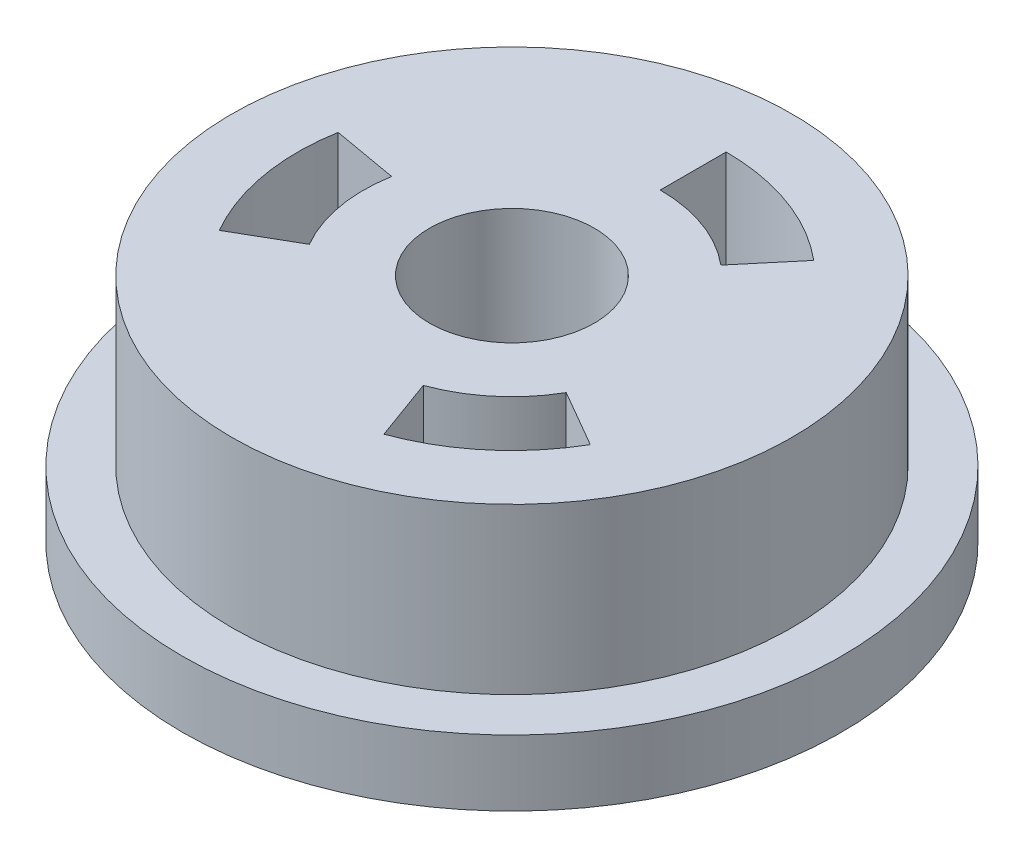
ISO-10303-21;
HEADER;
FILE_DESCRIPTION(('STEP AP214'),'2;1');
FILE_NAME('part.step','',(''),(''),'','','');
FILE_SCHEMA(('AUTOMOTIVE_DESIGN { 1 0 10303 214 1 1 1 1 }'));
ENDSEC;
DATA;
#1=APPLICATION_CONTEXT('core data for automotive mechanical design processes');
#2=APPLICATION_PROTOCOL_DEFINITION('international standard','automotive_design',2000,#1);
#3=PRODUCT_CONTEXT('',#1,'mechanical');
#4=PRODUCT('Part','Part','',(#3));
#5=PRODUCT_RELATED_PRODUCT_CATEGORY('part','',(#4));
#6=PRODUCT_DEFINITION_FORMATION('','',#4);
#7=PRODUCT_DEFINITION_CONTEXT('part definition',#1,'design');
#8=PRODUCT_DEFINITION('design','',#6,#7);
#9=PRODUCT_DEFINITION_SHAPE('','',#8);
#10=(LENGTH_UNIT() NAMED_UNIT(*) SI_UNIT(.MILLI.,.METRE.));
#11=(NAMED_UNIT(*) PLANE_ANGLE_UNIT() SI_UNIT($,.RADIAN.));
#12=(NAMED_UNIT(*) SI_UNIT($,.STERADIAN.) SOLID_ANGLE_UNIT());
#13=UNCERTAINTY_MEASURE_WITH_UNIT(LENGTH_MEASURE(1.E-05),#10,'distance_accuracy_value','');
#14=(GEOMETRIC_REPRESENTATION_CONTEXT(3) GLOBAL_UNCERTAINTY_ASSIGNED_CONTEXT((#13)) GLOBAL_UNIT_ASSIGNED_CONTEXT((#10,
#11,#12)) REPRESENTATION_CONTEXT('',''));
#15=CARTESIAN_POINT('',(0.,0.,0.));
#16=DIRECTION('',(0.,0.,1.));
#17=DIRECTION('',(1.,0.,0.));
#18=AXIS2_PLACEMENT_3D('',#15,#16,#17);
#19=CARTESIAN_POINT('',(0.,0.,0.));
#20=DIRECTION('',(0.,1.,0.));
#21=DIRECTION('',(0.,0.,1.));
#22=AXIS2_PLACEMENT_3D('',#19,#20,#21);
#23=PLANE('',#22);
#24=CARTESIAN_POINT('',(0.,0.,0.));
#25=DIRECTION('',(0.,1.,0.));
#26=DIRECTION('',(0.,0.,1.));
#27=AXIS2_PLACEMENT_3D('',#24,#25,#26);
#28=CIRCLE('',#27,9.99999999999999);
#29=CARTESIAN_POINT('',(0.,0.,9.99999999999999));
#30=VERTEX_POINT('',#29);
#31=EDGE_CURVE('E39',#30,#30,#28,.T.);
#32=ORIENTED_EDGE('',*,*,#31,.T.);
#33=EDGE_LOOP('',(#32));
#34=FACE_BOUND('',#33,.T.);
#35=CARTESIAN_POINT('',(0.,0.,0.));
#36=DIRECTION('',(0.,1.,0.));
#37=DIRECTION('',(0.,0.,1.));
#38=AXIS2_PLACEMENT_3D('',#35,#36,#37);
#39=CIRCLE('',#38,8.5);
#40=CARTESIAN_POINT('',(0.,0.,8.5));
#41=VERTEX_POINT('',#40);
#42=EDGE_CURVE('E217',#41,#41,#39,.T.);
#43=ORIENTED_EDGE('',*,*,#42,.F.);
#44=EDGE_LOOP('',(#43));
#45=FACE_BOUND('',#44,.T.);
#46=ADVANCED_FACE('F35',(#34,#45),#23,.T.);
#47=CARTESIAN_POINT('',(0.,-2.,0.));
#48=DIRECTION('',(0.,1.,0.));
#49=DIRECTION('',(0.,0.,1.));
#50=AXIS2_PLACEMENT_3D('',#47,#48,#49);
#51=CYLINDRICAL_SURFACE('',#50,9.99999999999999);
#52=CARTESIAN_POINT('',(0.,-2.,0.));
#53=DIRECTION('',(0.,1.,0.));
#54=DIRECTION('',(0.,0.,1.));
#55=AXIS2_PLACEMENT_3D('',#52,#53,#54);
#56=CIRCLE('',#55,9.99999999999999);
#57=CARTESIAN_POINT('',(0.,-2.,9.99999999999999));
#58=VERTEX_POINT('',#57);
#59=EDGE_CURVE('E11',#58,#58,#56,.T.);
#60=ORIENTED_EDGE('',*,*,#59,.T.);
#61=EDGE_LOOP('',(#60));
#62=FACE_BOUND('',#61,.T.);
#63=ORIENTED_EDGE('',*,*,#31,.F.);
#64=EDGE_LOOP('',(#63));
#65=FACE_BOUND('',#64,.T.);
#66=ADVANCED_FACE('F37',(#62,#65),#51,.T.);
#67=CARTESIAN_POINT('',(0.,-2.,0.));
#68=DIRECTION('',(0.,1.,0.));
#69=DIRECTION('',(0.,0.,1.));
#70=AXIS2_PLACEMENT_3D('',#67,#68,#69);
#71=PLANE('',#70);
#72=CARTESIAN_POINT('',(0.,-2.,0.));
#73=DIRECTION('',(0.,1.,0.));
#74=DIRECTION('',(0.,0.,1.));
#75=AXIS2_PLACEMENT_3D('',#72,#73,#74);
#76=CIRCLE('',#75,2.5);
#77=CARTESIAN_POINT('',(0.,-2.,2.5));
#78=VERTEX_POINT('',#77);
#79=EDGE_CURVE('E156',#78,#78,#76,.T.);
#80=ORIENTED_EDGE('',*,*,#79,.T.);
#81=EDGE_LOOP('',(#80));
#82=FACE_BOUND('',#81,.T.);
#83=ORIENTED_EDGE('',*,*,#59,.F.);
#84=EDGE_LOOP('',(#83));
#85=FACE_BOUND('',#84,.T.);
#86=ADVANCED_FACE('F237',(#82,#85),#71,.F.);
#87=CARTESIAN_POINT('',(0.,5.,0.));
#88=DIRECTION('',(0.,-1.,0.));
#89=DIRECTION('',(0.,0.,-1.));
#90=AXIS2_PLACEMENT_3D('',#87,#88,#89);
#91=CYLINDRICAL_SURFACE('',#90,8.5);
#92=CARTESIAN_POINT('',(0.,5.,0.));
#93=DIRECTION('',(0.,1.,0.));
#94=DIRECTION('',(0.,0.,1.));
#95=AXIS2_PLACEMENT_3D('',#92,#93,#94);
#96=CIRCLE('',#95,8.5);
#97=CARTESIAN_POINT('',(0.,5.,8.5));
#98=VERTEX_POINT('',#97);
#99=EDGE_CURVE('E224',#98,#98,#96,.T.);
#100=ORIENTED_EDGE('',*,*,#99,.F.);
#101=EDGE_LOOP('',(#100));
#102=FACE_BOUND('',#101,.T.);
#103=ORIENTED_EDGE('',*,*,#42,.T.);
#104=EDGE_LOOP('',(#103));
#105=FACE_BOUND('',#104,.T.);
#106=ADVANCED_FACE('F230',(#102,#105),#91,.T.);
#107=CARTESIAN_POINT('',(0.,5.,0.));
#108=DIRECTION('',(0.,1.,0.));
#109=DIRECTION('',(0.,0.,1.));
#110=AXIS2_PLACEMENT_3D('',#107,#108,#109);
#111=PLANE('',#110);
#112=CARTESIAN_POINT('',(0.,5.,0.));
#113=DIRECTION('',(0.,1.,0.));
#114=DIRECTION('',(0.,0.,1.));
#115=AXIS2_PLACEMENT_3D('',#112,#113,#114);
#116=CIRCLE('',#115,2.5);
#117=CARTESIAN_POINT('',(0.,5.,2.5));
#118=VERTEX_POINT('',#117);
#119=EDGE_CURVE('E149',#118,#118,#116,.T.);
#120=ORIENTED_EDGE('',*,*,#119,.F.);
#121=EDGE_LOOP('',(#120));
#122=FACE_BOUND('',#121,.T.);
#123=DIRECTION('',(0.342020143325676,0.,0.939692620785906));
#124=VECTOR('',#123,1.);
#125=CARTESIAN_POINT('',(0.,5.,0.));
#126=LINE('',#125,#124);
#127=CARTESIAN_POINT('',(1.53909064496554,5.,4.22861679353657));
#128=VERTEX_POINT('',#127);
#129=CARTESIAN_POINT('',(2.22313093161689,5.,6.10800203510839));
#130=VERTEX_POINT('',#129);
#131=EDGE_CURVE('E50',#128,#130,#126,.T.);
#132=ORIENTED_EDGE('',*,*,#131,.F.);
#133=CARTESIAN_POINT('',(0.,5.,0.));
#134=DIRECTION('',(0.,1.,0.));
#135=DIRECTION('',(-0.866025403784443,0.,-0.499999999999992));
#136=AXIS2_PLACEMENT_3D('',#133,#134,#135);
#137=CIRCLE('',#136,4.5);
#138=CARTESIAN_POINT('',(3.89711431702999,5.,2.24999999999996));
#139=VERTEX_POINT('',#138);
#140=EDGE_CURVE('E143',#128,#139,#137,.T.);
#141=ORIENTED_EDGE('',*,*,#140,.T.);
#142=DIRECTION('',(0.866025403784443,0.,0.499999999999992));
#143=VECTOR('',#142,1.);
#144=CARTESIAN_POINT('',(0.,5.,0.));
#145=LINE('',#144,#143);
#146=CARTESIAN_POINT('',(5.62916512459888,5.,3.24999999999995));
#147=VERTEX_POINT('',#146);
#148=EDGE_CURVE('E146',#139,#147,#145,.T.);
#149=ORIENTED_EDGE('',*,*,#148,.T.);
#150=CARTESIAN_POINT('',(0.,5.,0.));
#151=DIRECTION('',(0.,1.,0.));
#152=DIRECTION('',(-0.866025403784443,0.,-0.499999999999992));
#153=AXIS2_PLACEMENT_3D('',#150,#151,#152);
#154=CIRCLE('',#153,6.5);
#155=EDGE_CURVE('E155',#130,#147,#154,.T.);
#156=ORIENTED_EDGE('',*,*,#155,.F.);
#157=EDGE_LOOP('',(#132,#141,#149,#156));
#158=FACE_BOUND('',#157,.T.);
#159=DIRECTION('',(-0.984807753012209,0.,-0.173648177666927));
#160=VECTOR('',#159,1.);
#161=CARTESIAN_POINT('',(0.,5.,0.));
#162=LINE('',#161,#160);
#163=CARTESIAN_POINT('',(-4.43163488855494,5.,-0.781416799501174));
#164=VERTEX_POINT('',#163);
#165=CARTESIAN_POINT('',(-6.40125039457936,5.,-1.12871315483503));
#166=VERTEX_POINT('',#165);
#167=EDGE_CURVE('E58',#164,#166,#162,.T.);
#168=ORIENTED_EDGE('',*,*,#167,.F.);
#169=CARTESIAN_POINT('',(0.,5.,0.));
#170=DIRECTION('',(0.,1.,0.));
#171=DIRECTION('',(0.866025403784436,0.,-0.500000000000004));
#172=AXIS2_PLACEMENT_3D('',#169,#170,#171);
#173=CIRCLE('',#172,4.5);
#174=CARTESIAN_POINT('',(-3.89711431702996,5.,2.25000000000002));
#175=VERTEX_POINT('',#174);
#176=EDGE_CURVE('E169',#164,#175,#173,.T.);
#177=ORIENTED_EDGE('',*,*,#176,.T.);
#178=DIRECTION('',(-0.866025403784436,0.,0.500000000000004));
#179=VECTOR('',#178,1.);
#180=CARTESIAN_POINT('',(0.,5.,0.));
#181=LINE('',#180,#179);
#182=CARTESIAN_POINT('',(-5.62916512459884,5.,3.25000000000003));
#183=VERTEX_POINT('',#182);
#184=EDGE_CURVE('E181',#175,#183,#181,.T.);
#185=ORIENTED_EDGE('',*,*,#184,.T.);
#186=CARTESIAN_POINT('',(0.,5.,0.));
#187=DIRECTION('',(0.,1.,0.));
#188=DIRECTION('',(0.866025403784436,0.,-0.500000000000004));
#189=AXIS2_PLACEMENT_3D('',#186,#187,#188);
#190=CIRCLE('',#189,6.5);
#191=EDGE_CURVE('E178',#166,#183,#190,.T.);
#192=ORIENTED_EDGE('',*,*,#191,.F.);
#193=EDGE_LOOP('',(#168,#177,#185,#192));
#194=FACE_BOUND('',#193,.T.);
#195=DIRECTION('',(0.64278760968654,0.,-0.766044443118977));
#196=VECTOR('',#195,1.);
#197=CARTESIAN_POINT('',(0.,5.,0.));
#198=LINE('',#197,#196);
#199=CARTESIAN_POINT('',(2.89254424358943,5.,-3.4471999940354));
#200=VERTEX_POINT('',#199);
#201=CARTESIAN_POINT('',(4.17811946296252,5.,-4.97928888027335));
#202=VERTEX_POINT('',#201);
#203=EDGE_CURVE('E188',#200,#202,#198,.T.);
#204=ORIENTED_EDGE('',*,*,#203,.F.);
#205=CARTESIAN_POINT('',(0.,5.,0.));
#206=DIRECTION('',(0.,1.,0.));
#207=DIRECTION('',(0.,0.,1.));
#208=AXIS2_PLACEMENT_3D('',#205,#206,#207);
#209=CIRCLE('',#208,4.5);
#210=CARTESIAN_POINT('',(0.,5.,-4.5));
#211=VERTEX_POINT('',#210);
#212=EDGE_CURVE('E198',#200,#211,#209,.T.);
#213=ORIENTED_EDGE('',*,*,#212,.T.);
#214=DIRECTION('',(0.,0.,-1.));
#215=VECTOR('',#214,1.);
#216=CARTESIAN_POINT('',(0.,5.,0.));
#217=LINE('',#216,#215);
#218=CARTESIAN_POINT('',(0.,5.,-6.5));
#219=VERTEX_POINT('',#218);
#220=EDGE_CURVE('E210',#211,#219,#217,.T.);
#221=ORIENTED_EDGE('',*,*,#220,.T.);
#222=CARTESIAN_POINT('',(0.,5.,0.));
#223=DIRECTION('',(0.,1.,0.));
#224=DIRECTION('',(0.,0.,1.));
#225=AXIS2_PLACEMENT_3D('',#222,#223,#224);
#226=CIRCLE('',#225,6.5);
#227=EDGE_CURVE('E207',#202,#219,#226,.T.);
#228=ORIENTED_EDGE('',*,*,#227,.F.);
#229=EDGE_LOOP('',(#204,#213,#221,#228));
#230=FACE_BOUND('',#229,.T.);
#231=ORIENTED_EDGE('',*,*,#99,.T.);
#232=EDGE_LOOP('',(#231));
#233=FACE_BOUND('',#232,.T.);
#234=ADVANCED_FACE('F246',(#122,#158,#194,#230,#233),#111,.T.);
#235=CARTESIAN_POINT('',(0.,2.,0.));
#236=DIRECTION('',(0.766044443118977,0.,0.64278760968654));
#237=DIRECTION('',(0.64278760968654,0.,-0.766044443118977));
#238=AXIS2_PLACEMENT_3D('',#235,#236,#237);
#239=PLANE('',#238);
#240=ORIENTED_EDGE('',*,*,#203,.T.);
#241=DIRECTION('',(0.,1.,0.));
#242=VECTOR('',#241,1.);
#243=CARTESIAN_POINT('',(4.17811946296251,2.,-4.97928888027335));
#244=LINE('',#243,#242);
#245=CARTESIAN_POINT('',(4.17811946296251,2.,-4.97928888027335));
#246=VERTEX_POINT('',#245);
#247=EDGE_CURVE('E205',#246,#202,#244,.T.);
#248=ORIENTED_EDGE('',*,*,#247,.F.);
#249=DIRECTION('',(0.64278760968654,0.,-0.766044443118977));
#250=VECTOR('',#249,1.);
#251=CARTESIAN_POINT('',(0.,2.,0.));
#252=LINE('',#251,#250);
#253=CARTESIAN_POINT('',(2.89254424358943,2.,-3.4471999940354));
#254=VERTEX_POINT('',#253);
#255=EDGE_CURVE('E194',#254,#246,#252,.T.);
#256=ORIENTED_EDGE('',*,*,#255,.F.);
#257=DIRECTION('',(0.,1.,0.));
#258=VECTOR('',#257,1.);
#259=CARTESIAN_POINT('',(2.89254424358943,2.,-3.4471999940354));
#260=LINE('',#259,#258);
#261=EDGE_CURVE('E215',#254,#200,#260,.T.);
#262=ORIENTED_EDGE('',*,*,#261,.T.);
#263=EDGE_LOOP('',(#240,#248,#256,#262));
#264=FACE_BOUND('',#263,.T.);
#265=ADVANCED_FACE('F250',(#264),#239,.F.);
#266=CARTESIAN_POINT('',(0.,2.,0.));
#267=DIRECTION('',(0.,1.,0.));
#268=DIRECTION('',(0.,0.,1.));
#269=AXIS2_PLACEMENT_3D('',#266,#267,#268);
#270=CYLINDRICAL_SURFACE('',#269,4.5);
#271=ORIENTED_EDGE('',*,*,#212,.F.);
#272=ORIENTED_EDGE('',*,*,#261,.F.);
#273=CARTESIAN_POINT('',(0.,2.,0.));
#274=DIRECTION('',(0.,1.,0.));
#275=DIRECTION('',(0.,0.,1.));
#276=AXIS2_PLACEMENT_3D('',#273,#274,#275);
#277=CIRCLE('',#276,4.5);
#278=CARTESIAN_POINT('',(0.,2.,-4.5));
#279=VERTEX_POINT('',#278);
#280=EDGE_CURVE('E203',#254,#279,#277,.T.);
#281=ORIENTED_EDGE('',*,*,#280,.T.);
#282=DIRECTION('',(0.,1.,0.));
#283=VECTOR('',#282,1.);
#284=CARTESIAN_POINT('',(0.,2.,-4.5));
#285=LINE('',#284,#283);
#286=EDGE_CURVE('E218',#279,#211,#285,.T.);
#287=ORIENTED_EDGE('',*,*,#286,.T.);
#288=EDGE_LOOP('',(#271,#272,#281,#287));
#289=FACE_BOUND('',#288,.T.);
#290=ADVANCED_FACE('F254',(#289),#270,.T.);
#291=CARTESIAN_POINT('',(0.,2.,0.));
#292=DIRECTION('',(1.,0.,0.));
#293=DIRECTION('',(0.,0.,-1.));
#294=AXIS2_PLACEMENT_3D('',#291,#292,#293);
#295=PLANE('',#294);
#296=ORIENTED_EDGE('',*,*,#220,.F.);
#297=ORIENTED_EDGE('',*,*,#286,.F.);
#298=DIRECTION('',(0.,0.,-1.));
#299=VECTOR('',#298,1.);
#300=CARTESIAN_POINT('',(0.,2.,0.));
#301=LINE('',#300,#299);
#302=CARTESIAN_POINT('',(0.,2.,-6.5));
#303=VERTEX_POINT('',#302);
#304=EDGE_CURVE('E201',#279,#303,#301,.T.);
#305=ORIENTED_EDGE('',*,*,#304,.T.);
#306=DIRECTION('',(0.,1.,0.));
#307=VECTOR('',#306,1.);
#308=CARTESIAN_POINT('',(0.,2.,-6.5));
#309=LINE('',#308,#307);
#310=EDGE_CURVE('E220',#303,#219,#309,.T.);
#311=ORIENTED_EDGE('',*,*,#310,.T.);
#312=EDGE_LOOP('',(#296,#297,#305,#311));
#313=FACE_BOUND('',#312,.T.);
#314=ADVANCED_FACE('F260',(#313),#295,.T.);
#315=CARTESIAN_POINT('',(0.,2.,0.));
#316=DIRECTION('',(0.,1.,0.));
#317=DIRECTION('',(0.,0.,1.));
#318=AXIS2_PLACEMENT_3D('',#315,#316,#317);
#319=CYLINDRICAL_SURFACE('',#318,6.5);
#320=ORIENTED_EDGE('',*,*,#227,.T.);
#321=ORIENTED_EDGE('',*,*,#310,.F.);
#322=CARTESIAN_POINT('',(0.,2.,0.));
#323=DIRECTION('',(0.,1.,0.));
#324=DIRECTION('',(0.,0.,1.));
#325=AXIS2_PLACEMENT_3D('',#322,#323,#324);
#326=CIRCLE('',#325,6.5);
#327=EDGE_CURVE('E197',#246,#303,#326,.T.);
#328=ORIENTED_EDGE('',*,*,#327,.F.);
#329=ORIENTED_EDGE('',*,*,#247,.T.);
#330=EDGE_LOOP('',(#320,#321,#328,#329));
#331=FACE_BOUND('',#330,.T.);
#332=ADVANCED_FACE('F256',(#331),#319,.F.);
#333=CARTESIAN_POINT('',(0.,2.,0.));
#334=DIRECTION('',(0.,1.,0.));
#335=DIRECTION('',(0.,0.,1.));
#336=AXIS2_PLACEMENT_3D('',#333,#334,#335);
#337=PLANE('',#336);
#338=ORIENTED_EDGE('',*,*,#255,.T.);
#339=ORIENTED_EDGE('',*,*,#327,.T.);
#340=ORIENTED_EDGE('',*,*,#304,.F.);
#341=ORIENTED_EDGE('',*,*,#280,.F.);
#342=EDGE_LOOP('',(#338,#339,#340,#341));
#343=FACE_BOUND('',#342,.T.);
#344=ADVANCED_FACE('F259',(#343),#337,.T.);
#345=CARTESIAN_POINT('',(0.,2.,0.));
#346=DIRECTION('',(0.173648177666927,0.,-0.984807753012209));
#347=DIRECTION('',(-0.984807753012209,0.,-0.173648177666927));
#348=AXIS2_PLACEMENT_3D('',#345,#346,#347);
#349=PLANE('',#348);
#350=ORIENTED_EDGE('',*,*,#167,.T.);
#351=DIRECTION('',(0.,1.,0.));
#352=VECTOR('',#351,1.);
#353=CARTESIAN_POINT('',(-6.40125039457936,2.,-1.12871315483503));
#354=LINE('',#353,#352);
#355=CARTESIAN_POINT('',(-6.40125039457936,2.,-1.12871315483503));
#356=VERTEX_POINT('',#355);
#357=EDGE_CURVE('E176',#356,#166,#354,.T.);
#358=ORIENTED_EDGE('',*,*,#357,.F.);
#359=DIRECTION('',(-0.984807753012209,0.,-0.173648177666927));
#360=VECTOR('',#359,1.);
#361=CARTESIAN_POINT('',(0.,2.,0.));
#362=LINE('',#361,#360);
#363=CARTESIAN_POINT('',(-4.43163488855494,2.,-0.781416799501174));
#364=VERTEX_POINT('',#363);
#365=EDGE_CURVE('E165',#364,#356,#362,.T.);
#366=ORIENTED_EDGE('',*,*,#365,.F.);
#367=DIRECTION('',(0.,1.,0.));
#368=VECTOR('',#367,1.);
#369=CARTESIAN_POINT('',(-4.43163488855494,2.,-0.781416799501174));
#370=LINE('',#369,#368);
#371=EDGE_CURVE('E186',#364,#164,#370,.T.);
#372=ORIENTED_EDGE('',*,*,#371,.T.);
#373=EDGE_LOOP('',(#350,#358,#366,#372));
#374=FACE_BOUND('',#373,.T.);
#375=ADVANCED_FACE('F270',(#374),#349,.F.);
#376=CARTESIAN_POINT('',(0.,2.,0.));
#377=DIRECTION('',(0.,1.,0.));
#378=DIRECTION('',(0.,0.,1.));
#379=AXIS2_PLACEMENT_3D('',#376,#377,#378);
#380=CYLINDRICAL_SURFACE('',#379,4.5);
#381=ORIENTED_EDGE('',*,*,#176,.F.);
#382=ORIENTED_EDGE('',*,*,#371,.F.);
#383=CARTESIAN_POINT('',(0.,2.,0.));
#384=DIRECTION('',(0.,1.,0.));
#385=DIRECTION('',(0.866025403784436,0.,-0.500000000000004));
#386=AXIS2_PLACEMENT_3D('',#383,#384,#385);
#387=CIRCLE('',#386,4.5);
#388=CARTESIAN_POINT('',(-3.89711431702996,2.,2.25000000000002));
#389=VERTEX_POINT('',#388);
#390=EDGE_CURVE('E174',#364,#389,#387,.T.);
#391=ORIENTED_EDGE('',*,*,#390,.T.);
#392=DIRECTION('',(0.,1.,0.));
#393=VECTOR('',#392,1.);
#394=CARTESIAN_POINT('',(-3.89711431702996,2.,2.25000000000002));
#395=LINE('',#394,#393);
#396=EDGE_CURVE('E189',#389,#175,#395,.T.);
#397=ORIENTED_EDGE('',*,*,#396,.T.);
#398=EDGE_LOOP('',(#381,#382,#391,#397));
#399=FACE_BOUND('',#398,.T.);
#400=ADVANCED_FACE('F274',(#399),#380,.T.);
#401=CARTESIAN_POINT('',(0.,2.,0.));
#402=DIRECTION('',(-0.500000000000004,0.,-0.866025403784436));
#403=DIRECTION('',(-0.866025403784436,0.,0.500000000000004));
#404=AXIS2_PLACEMENT_3D('',#401,#402,#403);
#405=PLANE('',#404);
#406=ORIENTED_EDGE('',*,*,#184,.F.);
#407=ORIENTED_EDGE('',*,*,#396,.F.);
#408=DIRECTION('',(-0.866025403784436,0.,0.500000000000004));
#409=VECTOR('',#408,1.);
#410=CARTESIAN_POINT('',(0.,2.,0.));
#411=LINE('',#410,#409);
#412=CARTESIAN_POINT('',(-5.62916512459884,2.,3.25000000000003));
#413=VERTEX_POINT('',#412);
#414=EDGE_CURVE('E172',#389,#413,#411,.T.);
#415=ORIENTED_EDGE('',*,*,#414,.T.);
#416=DIRECTION('',(0.,1.,0.));
#417=VECTOR('',#416,1.);
#418=CARTESIAN_POINT('',(-5.62916512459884,2.,3.25000000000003));
#419=LINE('',#418,#417);
#420=EDGE_CURVE('E191',#413,#183,#419,.T.);
#421=ORIENTED_EDGE('',*,*,#420,.T.);
#422=EDGE_LOOP('',(#406,#407,#415,#421));
#423=FACE_BOUND('',#422,.T.);
#424=ADVANCED_FACE('F279',(#423),#405,.T.);
#425=CARTESIAN_POINT('',(0.,2.,0.));
#426=DIRECTION('',(0.,1.,0.));
#427=DIRECTION('',(0.,0.,1.));
#428=AXIS2_PLACEMENT_3D('',#425,#426,#427);
#429=CYLINDRICAL_SURFACE('',#428,6.5);
#430=ORIENTED_EDGE('',*,*,#191,.T.);
#431=ORIENTED_EDGE('',*,*,#420,.F.);
#432=CARTESIAN_POINT('',(0.,2.,0.));
#433=DIRECTION('',(0.,1.,0.));
#434=DIRECTION('',(0.866025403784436,0.,-0.500000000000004));
#435=AXIS2_PLACEMENT_3D('',#432,#433,#434);
#436=CIRCLE('',#435,6.5);
#437=EDGE_CURVE('E168',#356,#413,#436,.T.);
#438=ORIENTED_EDGE('',*,*,#437,.F.);
#439=ORIENTED_EDGE('',*,*,#357,.T.);
#440=EDGE_LOOP('',(#430,#431,#438,#439));
#441=FACE_BOUND('',#440,.T.);
#442=ADVANCED_FACE('F275',(#441),#429,.F.);
#443=CARTESIAN_POINT('',(0.,2.,0.));
#444=DIRECTION('',(0.,1.,0.));
#445=DIRECTION('',(0.866025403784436,0.,-0.500000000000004));
#446=AXIS2_PLACEMENT_3D('',#443,#444,#445);
#447=PLANE('',#446);
#448=ORIENTED_EDGE('',*,*,#365,.T.);
#449=ORIENTED_EDGE('',*,*,#437,.T.);
#450=ORIENTED_EDGE('',*,*,#414,.F.);
#451=ORIENTED_EDGE('',*,*,#390,.F.);
#452=EDGE_LOOP('',(#448,#449,#450,#451));
#453=FACE_BOUND('',#452,.T.);
#454=ADVANCED_FACE('F278',(#453),#447,.T.);
#455=CARTESIAN_POINT('',(0.,2.,0.));
#456=DIRECTION('',(-0.939692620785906,0.,0.342020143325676));
#457=DIRECTION('',(0.342020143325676,0.,0.939692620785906));
#458=AXIS2_PLACEMENT_3D('',#455,#456,#457);
#459=PLANE('',#458);
#460=ORIENTED_EDGE('',*,*,#131,.T.);
#461=DIRECTION('',(0.,1.,0.));
#462=VECTOR('',#461,1.);
#463=CARTESIAN_POINT('',(2.22313093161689,2.,6.10800203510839));
#464=LINE('',#463,#462);
#465=CARTESIAN_POINT('',(2.22313093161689,2.,6.10800203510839));
#466=VERTEX_POINT('',#465);
#467=EDGE_CURVE('E122',#466,#130,#464,.T.);
#468=ORIENTED_EDGE('',*,*,#467,.F.);
#469=DIRECTION('',(0.342020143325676,0.,0.939692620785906));
#470=VECTOR('',#469,1.);
#471=CARTESIAN_POINT('',(0.,2.,0.));
#472=LINE('',#471,#470);
#473=CARTESIAN_POINT('',(1.53909064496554,2.,4.22861679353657));
#474=VERTEX_POINT('',#473);
#475=EDGE_CURVE('E126',#474,#466,#472,.T.);
#476=ORIENTED_EDGE('',*,*,#475,.F.);
#477=DIRECTION('',(0.,1.,0.));
#478=VECTOR('',#477,1.);
#479=CARTESIAN_POINT('',(1.53909064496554,2.,4.22861679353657));
#480=LINE('',#479,#478);
#481=EDGE_CURVE('E160',#474,#128,#480,.T.);
#482=ORIENTED_EDGE('',*,*,#481,.T.);
#483=EDGE_LOOP('',(#460,#468,#476,#482));
#484=FACE_BOUND('',#483,.T.);
#485=ADVANCED_FACE('F124',(#484),#459,.F.);
#486=CARTESIAN_POINT('',(0.,2.,0.));
#487=DIRECTION('',(0.,1.,0.));
#488=DIRECTION('',(0.,0.,1.));
#489=AXIS2_PLACEMENT_3D('',#486,#487,#488);
#490=CYLINDRICAL_SURFACE('',#489,4.5);
#491=ORIENTED_EDGE('',*,*,#140,.F.);
#492=ORIENTED_EDGE('',*,*,#481,.F.);
#493=CARTESIAN_POINT('',(0.,2.,0.));
#494=DIRECTION('',(0.,1.,0.));
#495=DIRECTION('',(-0.866025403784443,0.,-0.499999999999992));
#496=AXIS2_PLACEMENT_3D('',#493,#494,#495);
#497=CIRCLE('',#496,4.5);
#498=CARTESIAN_POINT('',(3.89711431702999,2.,2.24999999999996));
#499=VERTEX_POINT('',#498);
#500=EDGE_CURVE('E131',#474,#499,#497,.T.);
#501=ORIENTED_EDGE('',*,*,#500,.T.);
#502=DIRECTION('',(0.,1.,0.));
#503=VECTOR('',#502,1.);
#504=CARTESIAN_POINT('',(3.89711431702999,2.,2.24999999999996));
#505=LINE('',#504,#503);
#506=EDGE_CURVE('E162',#499,#139,#505,.T.);
#507=ORIENTED_EDGE('',*,*,#506,.T.);
#508=EDGE_LOOP('',(#491,#492,#501,#507));
#509=FACE_BOUND('',#508,.T.);
#510=ADVANCED_FACE('F292',(#509),#490,.T.);
#511=CARTESIAN_POINT('',(0.,2.,0.));
#512=DIRECTION('',(-0.499999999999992,0.,0.866025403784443));
#513=DIRECTION('',(0.866025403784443,0.,0.499999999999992));
#514=AXIS2_PLACEMENT_3D('',#511,#512,#513);
#515=PLANE('',#514);
#516=ORIENTED_EDGE('',*,*,#148,.F.);
#517=ORIENTED_EDGE('',*,*,#506,.F.);
#518=DIRECTION('',(0.866025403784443,0.,0.499999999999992));
#519=VECTOR('',#518,1.);
#520=CARTESIAN_POINT('',(0.,2.,0.));
#521=LINE('',#520,#519);
#522=CARTESIAN_POINT('',(5.62916512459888,2.,3.24999999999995));
#523=VERTEX_POINT('',#522);
#524=EDGE_CURVE('E139',#499,#523,#521,.T.);
#525=ORIENTED_EDGE('',*,*,#524,.T.);
#526=DIRECTION('',(0.,1.,0.));
#527=VECTOR('',#526,1.);
#528=CARTESIAN_POINT('',(5.62916512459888,2.,3.24999999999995));
#529=LINE('',#528,#527);
#530=EDGE_CURVE('E130',#523,#147,#529,.T.);
#531=ORIENTED_EDGE('',*,*,#530,.T.);
#532=EDGE_LOOP('',(#516,#517,#525,#531));
#533=FACE_BOUND('',#532,.T.);
#534=ADVANCED_FACE('F295',(#533),#515,.T.);
#535=CARTESIAN_POINT('',(0.,2.,0.));
#536=DIRECTION('',(0.,1.,0.));
#537=DIRECTION('',(0.,0.,1.));
#538=AXIS2_PLACEMENT_3D('',#535,#536,#537);
#539=CYLINDRICAL_SURFACE('',#538,6.5);
#540=ORIENTED_EDGE('',*,*,#155,.T.);
#541=ORIENTED_EDGE('',*,*,#530,.F.);
#542=CARTESIAN_POINT('',(0.,2.,0.));
#543=DIRECTION('',(0.,1.,0.));
#544=DIRECTION('',(-0.866025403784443,0.,-0.499999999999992));
#545=AXIS2_PLACEMENT_3D('',#542,#543,#544);
#546=CIRCLE('',#545,6.5);
#547=EDGE_CURVE('E135',#466,#523,#546,.T.);
#548=ORIENTED_EDGE('',*,*,#547,.F.);
#549=ORIENTED_EDGE('',*,*,#467,.T.);
#550=EDGE_LOOP('',(#540,#541,#548,#549));
#551=FACE_BOUND('',#550,.T.);
#552=ADVANCED_FACE('F136',(#551),#539,.F.);
#553=CARTESIAN_POINT('',(0.,2.,0.));
#554=DIRECTION('',(0.,1.,0.));
#555=DIRECTION('',(-0.866025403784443,0.,-0.499999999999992));
#556=AXIS2_PLACEMENT_3D('',#553,#554,#555);
#557=PLANE('',#556);
#558=ORIENTED_EDGE('',*,*,#475,.T.);
#559=ORIENTED_EDGE('',*,*,#547,.T.);
#560=ORIENTED_EDGE('',*,*,#524,.F.);
#561=ORIENTED_EDGE('',*,*,#500,.F.);
#562=EDGE_LOOP('',(#558,#559,#560,#561));
#563=FACE_BOUND('',#562,.T.);
#564=ADVANCED_FACE('F142',(#563),#557,.T.);
#565=CARTESIAN_POINT('',(0.,-2.,0.));
#566=DIRECTION('',(0.,1.,0.));
#567=DIRECTION('',(0.,0.,1.));
#568=AXIS2_PLACEMENT_3D('',#565,#566,#567);
#569=CYLINDRICAL_SURFACE('',#568,2.5);
#570=ORIENTED_EDGE('',*,*,#79,.F.);
#571=EDGE_LOOP('',(#570));
#572=FACE_BOUND('',#571,.T.);
#573=ORIENTED_EDGE('',*,*,#119,.T.);
#574=EDGE_LOOP('',(#573));
#575=FACE_BOUND('',#574,.T.);
#576=ADVANCED_FACE('F304',(#572,#575),#569,.F.);
#577=CLOSED_SHELL('',(#46,#66,#86,#106,#234,#265,#290,#314,#332,#344,#375,#400,#424,#442,#454,
#485,#510,#534,#552,#564,#576));
#578=MANIFOLD_SOLID_BREP('B2',#577);
#579=ADVANCED_BREP_SHAPE_REPRESENTATION('',(#18,#578),#14);
#580=SHAPE_DEFINITION_REPRESENTATION(#9,#579);
ENDSEC;
END-ISO-10303-21;
